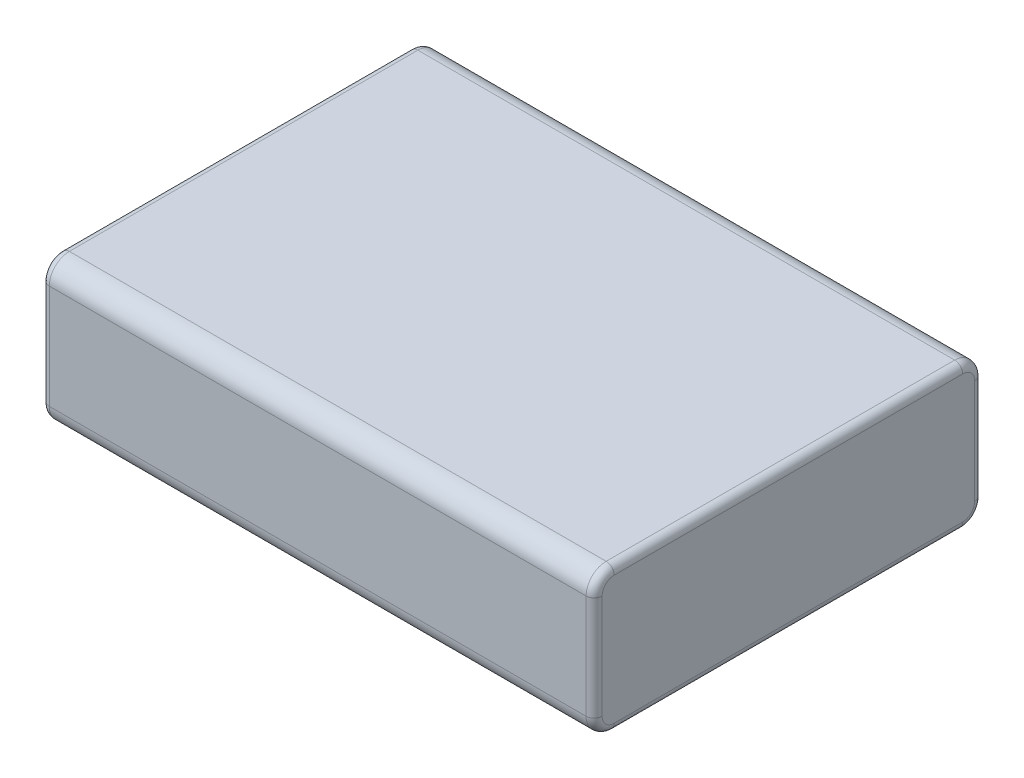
ISO-10303-21;
HEADER;
FILE_DESCRIPTION(('STEP AP214'),'2;1');
FILE_NAME('part.step','',(''),(''),'','','');
FILE_SCHEMA(('AUTOMOTIVE_DESIGN { 1 0 10303 214 1 1 1 1 }'));
ENDSEC;
DATA;
#1=APPLICATION_CONTEXT('core data for automotive mechanical design processes');
#2=APPLICATION_PROTOCOL_DEFINITION('international standard','automotive_design',2000,#1);
#3=PRODUCT_CONTEXT('',#1,'mechanical');
#4=PRODUCT('Part','Part','',(#3));
#5=PRODUCT_RELATED_PRODUCT_CATEGORY('part','',(#4));
#6=PRODUCT_DEFINITION_FORMATION('','',#4);
#7=PRODUCT_DEFINITION_CONTEXT('part definition',#1,'design');
#8=PRODUCT_DEFINITION('design','',#6,#7);
#9=PRODUCT_DEFINITION_SHAPE('','',#8);
#10=(LENGTH_UNIT() NAMED_UNIT(*) SI_UNIT(.MILLI.,.METRE.));
#11=(NAMED_UNIT(*) PLANE_ANGLE_UNIT() SI_UNIT($,.RADIAN.));
#12=(NAMED_UNIT(*) SI_UNIT($,.STERADIAN.) SOLID_ANGLE_UNIT());
#13=UNCERTAINTY_MEASURE_WITH_UNIT(LENGTH_MEASURE(1.E-05),#10,'distance_accuracy_value','');
#14=(GEOMETRIC_REPRESENTATION_CONTEXT(3) GLOBAL_UNCERTAINTY_ASSIGNED_CONTEXT((#13)) GLOBAL_UNIT_ASSIGNED_CONTEXT((#10,
#11,#12)) REPRESENTATION_CONTEXT('',''));
#15=CARTESIAN_POINT('',(0.,0.,0.));
#16=DIRECTION('',(0.,0.,1.));
#17=DIRECTION('',(1.,0.,0.));
#18=AXIS2_PLACEMENT_3D('',#15,#16,#17);
#19=CARTESIAN_POINT('',(0.,1.,0.));
#20=DIRECTION('',(0.,-1.,0.));
#21=DIRECTION('',(0.,0.,-1.));
#22=AXIS2_PLACEMENT_3D('',#19,#20,#21);
#23=PLANE('',#22);
#24=DIRECTION('',(0.,0.,-1.));
#25=VECTOR('',#24,1.);
#26=CARTESIAN_POINT('',(60.5,1.,-33.));
#27=LINE('',#26,#25);
#28=CARTESIAN_POINT('',(60.5,1.,-33.));
#29=VERTEX_POINT('',#28);
#30=CARTESIAN_POINT('',(60.5,1.,-42.));
#31=VERTEX_POINT('',#30);
#32=EDGE_CURVE('E231',#29,#31,#27,.T.);
#33=ORIENTED_EDGE('',*,*,#32,.T.);
#34=DIRECTION('',(1.,0.,0.));
#35=VECTOR('',#34,1.);
#36=CARTESIAN_POINT('',(60.5,1.,-42.));
#37=LINE('',#36,#35);
#38=CARTESIAN_POINT('',(65.,1.,-42.));
#39=VERTEX_POINT('',#38);
#40=EDGE_CURVE('E234',#31,#39,#37,.T.);
#41=ORIENTED_EDGE('',*,*,#40,.T.);
#42=DIRECTION('',(0.,0.,1.));
#43=VECTOR('',#42,1.);
#44=CARTESIAN_POINT('',(65.,1.,-33.));
#45=LINE('',#44,#43);
#46=CARTESIAN_POINT('',(65.,1.,-33.));
#47=VERTEX_POINT('',#46);
#48=EDGE_CURVE('E238',#39,#47,#45,.T.);
#49=ORIENTED_EDGE('',*,*,#48,.T.);
#50=DIRECTION('',(-1.,0.,0.));
#51=VECTOR('',#50,1.);
#52=CARTESIAN_POINT('',(60.5,1.,-33.));
#53=LINE('',#52,#51);
#54=EDGE_CURVE('E241',#47,#29,#53,.T.);
#55=ORIENTED_EDGE('',*,*,#54,.T.);
#56=EDGE_LOOP('',(#33,#41,#49,#55));
#57=FACE_BOUND('',#56,.T.);
#58=DIRECTION('',(1.,0.,0.));
#59=VECTOR('',#58,1.);
#60=CARTESIAN_POINT('',(61.25,1.,-36.75));
#61=LINE('',#60,#59);
#62=CARTESIAN_POINT('',(61.25,1.,-36.75));
#63=VERTEX_POINT('',#62);
#64=CARTESIAN_POINT('',(64.25,1.,-36.75));
#65=VERTEX_POINT('',#64);
#66=EDGE_CURVE('E805',#63,#65,#61,.T.);
#67=ORIENTED_EDGE('',*,*,#66,.F.);
#68=DIRECTION('',(0.,0.,-1.));
#69=VECTOR('',#68,1.);
#70=CARTESIAN_POINT('',(61.25,1.,-33.75));
#71=LINE('',#70,#69);
#72=CARTESIAN_POINT('',(61.25,1.,-33.75));
#73=VERTEX_POINT('',#72);
#74=EDGE_CURVE('E223',#73,#63,#71,.T.);
#75=ORIENTED_EDGE('',*,*,#74,.F.);
#76=DIRECTION('',(-1.,0.,0.));
#77=VECTOR('',#76,1.);
#78=CARTESIAN_POINT('',(61.25,1.,-33.75));
#79=LINE('',#78,#77);
#80=CARTESIAN_POINT('',(64.25,1.,-33.75));
#81=VERTEX_POINT('',#80);
#82=EDGE_CURVE('E219',#81,#73,#79,.T.);
#83=ORIENTED_EDGE('',*,*,#82,.F.);
#84=DIRECTION('',(0.,0.,1.));
#85=VECTOR('',#84,1.);
#86=CARTESIAN_POINT('',(64.25,1.,-33.75));
#87=LINE('',#86,#85);
#88=EDGE_CURVE('E802',#65,#81,#87,.T.);
#89=ORIENTED_EDGE('',*,*,#88,.F.);
#90=EDGE_LOOP('',(#67,#75,#83,#89));
#91=FACE_BOUND('',#90,.T.);
#92=ADVANCED_FACE('F38',(#57,#91),#23,.T.);
#93=CARTESIAN_POINT('',(0.,18.,0.));
#94=DIRECTION('',(1.,0.,0.));
#95=DIRECTION('',(0.,0.,-1.));
#96=AXIS2_PLACEMENT_3D('',#93,#94,#95);
#97=PLANE('',#96);
#98=DIRECTION('',(0.,0.,1.));
#99=VECTOR('',#98,1.);
#100=CARTESIAN_POINT('',(0.,17.,0.));
#101=LINE('',#100,#99);
#102=CARTESIAN_POINT('',(0.,17.,-2.5));
#103=VERTEX_POINT('',#102);
#104=CARTESIAN_POINT('',(0.,17.,-46.));
#105=VERTEX_POINT('',#104);
#106=EDGE_CURVE('E285',#103,#105,#101,.F.);
#107=ORIENTED_EDGE('',*,*,#106,.T.);
#108=CARTESIAN_POINT('',(0.,15.5,-46.));
#109=DIRECTION('',(1.,0.,0.));
#110=DIRECTION('',(0.,0.,-1.));
#111=AXIS2_PLACEMENT_3D('',#108,#109,#110);
#112=CIRCLE('',#111,1.5);
#113=CARTESIAN_POINT('',(0.,15.5,-47.5));
#114=VERTEX_POINT('',#113);
#115=EDGE_CURVE('E299',#105,#114,#112,.F.);
#116=ORIENTED_EDGE('',*,*,#115,.T.);
#117=DIRECTION('',(0.,-1.,0.));
#118=VECTOR('',#117,1.);
#119=CARTESIAN_POINT('',(0.,18.,-47.5));
#120=LINE('',#119,#118);
#121=CARTESIAN_POINT('',(0.,2.5,-47.5));
#122=VERTEX_POINT('',#121);
#123=EDGE_CURVE('E297',#114,#122,#120,.T.);
#124=ORIENTED_EDGE('',*,*,#123,.T.);
#125=CARTESIAN_POINT('',(0.,2.5,-46.));
#126=DIRECTION('',(1.,0.,0.));
#127=DIRECTION('',(0.,0.,-1.));
#128=AXIS2_PLACEMENT_3D('',#125,#126,#127);
#129=CIRCLE('',#128,1.5);
#130=CARTESIAN_POINT('',(0.,1.,-46.));
#131=VERTEX_POINT('',#130);
#132=EDGE_CURVE('E295',#122,#131,#129,.F.);
#133=ORIENTED_EDGE('',*,*,#132,.T.);
#134=DIRECTION('',(0.,0.,1.));
#135=VECTOR('',#134,1.);
#136=CARTESIAN_POINT('',(0.,1.,-2.5));
#137=LINE('',#136,#135);
#138=CARTESIAN_POINT('',(0.,1.,-2.5));
#139=VERTEX_POINT('',#138);
#140=EDGE_CURVE('E293',#131,#139,#137,.T.);
#141=ORIENTED_EDGE('',*,*,#140,.T.);
#142=CARTESIAN_POINT('',(0.,2.5,-2.5));
#143=DIRECTION('',(1.,0.,0.));
#144=DIRECTION('',(0.,0.,-1.));
#145=AXIS2_PLACEMENT_3D('',#142,#143,#144);
#146=CIRCLE('',#145,1.5);
#147=CARTESIAN_POINT('',(0.,2.5,-1.));
#148=VERTEX_POINT('',#147);
#149=EDGE_CURVE('E291',#139,#148,#146,.F.);
#150=ORIENTED_EDGE('',*,*,#149,.T.);
#151=DIRECTION('',(0.,-1.,0.));
#152=VECTOR('',#151,1.);
#153=CARTESIAN_POINT('',(0.,18.,-1.));
#154=LINE('',#153,#152);
#155=CARTESIAN_POINT('',(0.,15.5,-1.));
#156=VERTEX_POINT('',#155);
#157=EDGE_CURVE('E289',#148,#156,#154,.F.);
#158=ORIENTED_EDGE('',*,*,#157,.T.);
#159=CARTESIAN_POINT('',(0.,15.5,-2.5));
#160=DIRECTION('',(1.,0.,0.));
#161=DIRECTION('',(0.,0.,-1.));
#162=AXIS2_PLACEMENT_3D('',#159,#160,#161);
#163=CIRCLE('',#162,1.5);
#164=EDGE_CURVE('E287',#156,#103,#163,.F.);
#165=ORIENTED_EDGE('',*,*,#164,.T.);
#166=EDGE_LOOP('',(#107,#116,#124,#133,#141,#150,#158,#165));
#167=FACE_BOUND('',#166,.T.);
#168=ADVANCED_FACE('F438',(#167),#97,.F.);
#169=CARTESIAN_POINT('',(0.,18.,0.));
#170=DIRECTION('',(0.,0.,-1.));
#171=DIRECTION('',(-1.,0.,0.));
#172=AXIS2_PLACEMENT_3D('',#169,#170,#171);
#173=PLANE('',#172);
#174=DIRECTION('',(1.,0.,0.));
#175=VECTOR('',#174,1.);
#176=CARTESIAN_POINT('',(0.,15.5,0.));
#177=LINE('',#176,#175);
#178=CARTESIAN_POINT('',(68.,15.5,0.));
#179=VERTEX_POINT('',#178);
#180=CARTESIAN_POINT('',(1.,15.5,0.));
#181=VERTEX_POINT('',#180);
#182=EDGE_CURVE('E279',#179,#181,#177,.F.);
#183=ORIENTED_EDGE('',*,*,#182,.T.);
#184=DIRECTION('',(0.,-1.,0.));
#185=VECTOR('',#184,1.);
#186=CARTESIAN_POINT('',(1.,18.,0.));
#187=LINE('',#186,#185);
#188=CARTESIAN_POINT('',(1.,2.5,0.));
#189=VERTEX_POINT('',#188);
#190=EDGE_CURVE('E325',#181,#189,#187,.T.);
#191=ORIENTED_EDGE('',*,*,#190,.T.);
#192=DIRECTION('',(1.,0.,0.));
#193=VECTOR('',#192,1.);
#194=CARTESIAN_POINT('',(69.,2.5,0.));
#195=LINE('',#194,#193);
#196=CARTESIAN_POINT('',(68.,2.5,0.));
#197=VERTEX_POINT('',#196);
#198=EDGE_CURVE('E282',#189,#197,#195,.T.);
#199=ORIENTED_EDGE('',*,*,#198,.T.);
#200=DIRECTION('',(0.,-1.,0.));
#201=VECTOR('',#200,1.);
#202=CARTESIAN_POINT('',(68.,18.,0.));
#203=LINE('',#202,#201);
#204=EDGE_CURVE('E323',#197,#179,#203,.F.);
#205=ORIENTED_EDGE('',*,*,#204,.T.);
#206=EDGE_LOOP('',(#183,#191,#199,#205));
#207=FACE_BOUND('',#206,.T.);
#208=ADVANCED_FACE('F462',(#207),#173,.F.);
#209=CARTESIAN_POINT('',(69.,18.,0.));
#210=DIRECTION('',(-1.,0.,0.));
#211=DIRECTION('',(0.,0.,1.));
#212=AXIS2_PLACEMENT_3D('',#209,#210,#211);
#213=PLANE('',#212);
#214=DIRECTION('',(0.,0.,-1.));
#215=VECTOR('',#214,1.);
#216=CARTESIAN_POINT('',(69.,17.,0.));
#217=LINE('',#216,#215);
#218=CARTESIAN_POINT('',(69.,17.,-46.));
#219=VERTEX_POINT('',#218);
#220=CARTESIAN_POINT('',(69.,17.,-2.5));
#221=VERTEX_POINT('',#220);
#222=EDGE_CURVE('E332',#219,#221,#217,.F.);
#223=ORIENTED_EDGE('',*,*,#222,.T.);
#224=CARTESIAN_POINT('',(69.,15.5,-2.5));
#225=DIRECTION('',(-1.,0.,0.));
#226=DIRECTION('',(0.,0.,1.));
#227=AXIS2_PLACEMENT_3D('',#224,#225,#226);
#228=CIRCLE('',#227,1.5);
#229=CARTESIAN_POINT('',(69.,15.5,-1.));
#230=VERTEX_POINT('',#229);
#231=EDGE_CURVE('E346',#221,#230,#228,.F.);
#232=ORIENTED_EDGE('',*,*,#231,.T.);
#233=DIRECTION('',(0.,-1.,0.));
#234=VECTOR('',#233,1.);
#235=CARTESIAN_POINT('',(69.,18.,-1.));
#236=LINE('',#235,#234);
#237=CARTESIAN_POINT('',(69.,2.5,-1.));
#238=VERTEX_POINT('',#237);
#239=EDGE_CURVE('E344',#230,#238,#236,.T.);
#240=ORIENTED_EDGE('',*,*,#239,.T.);
#241=CARTESIAN_POINT('',(69.,2.5,-2.5));
#242=DIRECTION('',(-1.,0.,0.));
#243=DIRECTION('',(0.,0.,1.));
#244=AXIS2_PLACEMENT_3D('',#241,#242,#243);
#245=CIRCLE('',#244,1.5);
#246=CARTESIAN_POINT('',(69.,1.,-2.5));
#247=VERTEX_POINT('',#246);
#248=EDGE_CURVE('E342',#238,#247,#245,.F.);
#249=ORIENTED_EDGE('',*,*,#248,.T.);
#250=DIRECTION('',(0.,0.,-1.));
#251=VECTOR('',#250,1.);
#252=CARTESIAN_POINT('',(69.,1.,-46.));
#253=LINE('',#252,#251);
#254=CARTESIAN_POINT('',(69.,1.,-46.));
#255=VERTEX_POINT('',#254);
#256=EDGE_CURVE('E340',#247,#255,#253,.T.);
#257=ORIENTED_EDGE('',*,*,#256,.T.);
#258=CARTESIAN_POINT('',(69.,2.5,-46.));
#259=DIRECTION('',(-1.,0.,0.));
#260=DIRECTION('',(0.,0.,1.));
#261=AXIS2_PLACEMENT_3D('',#258,#259,#260);
#262=CIRCLE('',#261,1.5);
#263=CARTESIAN_POINT('',(69.,2.5,-47.5));
#264=VERTEX_POINT('',#263);
#265=EDGE_CURVE('E338',#255,#264,#262,.F.);
#266=ORIENTED_EDGE('',*,*,#265,.T.);
#267=DIRECTION('',(0.,-1.,0.));
#268=VECTOR('',#267,1.);
#269=CARTESIAN_POINT('',(69.,18.,-47.5));
#270=LINE('',#269,#268);
#271=CARTESIAN_POINT('',(69.,15.5,-47.5));
#272=VERTEX_POINT('',#271);
#273=EDGE_CURVE('E336',#264,#272,#270,.F.);
#274=ORIENTED_EDGE('',*,*,#273,.T.);
#275=CARTESIAN_POINT('',(69.,15.5,-46.));
#276=DIRECTION('',(-1.,0.,0.));
#277=DIRECTION('',(0.,0.,1.));
#278=AXIS2_PLACEMENT_3D('',#275,#276,#277);
#279=CIRCLE('',#278,1.5);
#280=EDGE_CURVE('E334',#272,#219,#279,.F.);
#281=ORIENTED_EDGE('',*,*,#280,.T.);
#282=EDGE_LOOP('',(#223,#232,#240,#249,#257,#266,#274,#281));
#283=FACE_BOUND('',#282,.T.);
#284=ADVANCED_FACE('F514',(#283),#213,.F.);
#285=CARTESIAN_POINT('',(0.,18.,-48.5));
#286=DIRECTION('',(0.,0.,1.));
#287=DIRECTION('',(1.,0.,0.));
#288=AXIS2_PLACEMENT_3D('',#285,#286,#287);
#289=PLANE('',#288);
#290=DIRECTION('',(-1.,0.,0.));
#291=VECTOR('',#290,1.);
#292=CARTESIAN_POINT('',(0.,2.5,-48.5));
#293=LINE('',#292,#291);
#294=CARTESIAN_POINT('',(68.,2.5,-48.5));
#295=VERTEX_POINT('',#294);
#296=CARTESIAN_POINT('',(1.,2.5,-48.5));
#297=VERTEX_POINT('',#296);
#298=EDGE_CURVE('E263',#295,#297,#293,.T.);
#299=ORIENTED_EDGE('',*,*,#298,.T.);
#300=DIRECTION('',(0.,-1.,0.));
#301=VECTOR('',#300,1.);
#302=CARTESIAN_POINT('',(1.,18.,-48.5));
#303=LINE('',#302,#301);
#304=CARTESIAN_POINT('',(1.,15.5,-48.5));
#305=VERTEX_POINT('',#304);
#306=EDGE_CURVE('E309',#297,#305,#303,.F.);
#307=ORIENTED_EDGE('',*,*,#306,.T.);
#308=DIRECTION('',(-1.,0.,0.));
#309=VECTOR('',#308,1.);
#310=CARTESIAN_POINT('',(0.,15.5,-48.5));
#311=LINE('',#310,#309);
#312=CARTESIAN_POINT('',(68.,15.5,-48.5));
#313=VERTEX_POINT('',#312);
#314=EDGE_CURVE('E260',#305,#313,#311,.F.);
#315=ORIENTED_EDGE('',*,*,#314,.T.);
#316=DIRECTION('',(0.,-1.,0.));
#317=VECTOR('',#316,1.);
#318=CARTESIAN_POINT('',(68.,18.,-48.5));
#319=LINE('',#318,#317);
#320=EDGE_CURVE('E307',#313,#295,#319,.T.);
#321=ORIENTED_EDGE('',*,*,#320,.T.);
#322=EDGE_LOOP('',(#299,#307,#315,#321));
#323=FACE_BOUND('',#322,.T.);
#324=ADVANCED_FACE('F421',(#323),#289,.F.);
#325=CARTESIAN_POINT('',(0.,18.,0.));
#326=DIRECTION('',(0.,-1.,0.));
#327=DIRECTION('',(0.,0.,-1.));
#328=AXIS2_PLACEMENT_3D('',#325,#326,#327);
#329=PLANE('',#328);
#330=DIRECTION('',(-1.,0.,0.));
#331=VECTOR('',#330,1.);
#332=CARTESIAN_POINT('',(0.,18.,-46.));
#333=LINE('',#332,#331);
#334=CARTESIAN_POINT('',(68.,18.,-46.));
#335=VERTEX_POINT('',#334);
#336=CARTESIAN_POINT('',(1.,18.,-46.));
#337=VERTEX_POINT('',#336);
#338=EDGE_CURVE('E276',#335,#337,#333,.T.);
#339=ORIENTED_EDGE('',*,*,#338,.T.);
#340=DIRECTION('',(0.,0.,1.));
#341=VECTOR('',#340,1.);
#342=CARTESIAN_POINT('',(1.,18.,0.));
#343=LINE('',#342,#341);
#344=CARTESIAN_POINT('',(1.,18.,-2.5));
#345=VERTEX_POINT('',#344);
#346=EDGE_CURVE('E11',#337,#345,#343,.T.);
#347=ORIENTED_EDGE('',*,*,#346,.T.);
#348=DIRECTION('',(1.,0.,0.));
#349=VECTOR('',#348,1.);
#350=CARTESIAN_POINT('',(0.,18.,-2.5));
#351=LINE('',#350,#349);
#352=CARTESIAN_POINT('',(68.,18.,-2.5));
#353=VERTEX_POINT('',#352);
#354=EDGE_CURVE('E273',#345,#353,#351,.T.);
#355=ORIENTED_EDGE('',*,*,#354,.T.);
#356=DIRECTION('',(0.,0.,-1.));
#357=VECTOR('',#356,1.);
#358=CARTESIAN_POINT('',(68.,18.,0.));
#359=LINE('',#358,#357);
#360=EDGE_CURVE('E47',#353,#335,#359,.T.);
#361=ORIENTED_EDGE('',*,*,#360,.T.);
#362=EDGE_LOOP('',(#339,#347,#355,#361));
#363=FACE_BOUND('',#362,.T.);
#364=ADVANCED_FACE('F446',(#363),#329,.F.);
#365=CARTESIAN_POINT('',(0.,0.,0.));
#366=DIRECTION('',(0.,-1.,0.));
#367=DIRECTION('',(0.,0.,-1.));
#368=AXIS2_PLACEMENT_3D('',#365,#366,#367);
#369=PLANE('',#368);
#370=DIRECTION('',(0.,0.,-1.));
#371=VECTOR('',#370,1.);
#372=CARTESIAN_POINT('',(60.5,0.,-33.));
#373=LINE('',#372,#371);
#374=CARTESIAN_POINT('',(60.5,0.,-33.));
#375=VERTEX_POINT('',#374);
#376=CARTESIAN_POINT('',(60.5,0.,-42.));
#377=VERTEX_POINT('',#376);
#378=EDGE_CURVE('E63',#375,#377,#373,.T.);
#379=ORIENTED_EDGE('',*,*,#378,.F.);
#380=DIRECTION('',(-1.,0.,0.));
#381=VECTOR('',#380,1.);
#382=CARTESIAN_POINT('',(60.5,0.,-33.));
#383=LINE('',#382,#381);
#384=CARTESIAN_POINT('',(65.,0.,-33.));
#385=VERTEX_POINT('',#384);
#386=EDGE_CURVE('E235',#385,#375,#383,.T.);
#387=ORIENTED_EDGE('',*,*,#386,.F.);
#388=DIRECTION('',(0.,0.,1.));
#389=VECTOR('',#388,1.);
#390=CARTESIAN_POINT('',(65.,0.,-33.));
#391=LINE('',#390,#389);
#392=CARTESIAN_POINT('',(65.,0.,-42.));
#393=VERTEX_POINT('',#392);
#394=EDGE_CURVE('E247',#393,#385,#391,.T.);
#395=ORIENTED_EDGE('',*,*,#394,.F.);
#396=DIRECTION('',(1.,0.,0.));
#397=VECTOR('',#396,1.);
#398=CARTESIAN_POINT('',(60.5,0.,-42.));
#399=LINE('',#398,#397);
#400=EDGE_CURVE('E226',#377,#393,#399,.T.);
#401=ORIENTED_EDGE('',*,*,#400,.F.);
#402=EDGE_LOOP('',(#379,#387,#395,#401));
#403=FACE_BOUND('',#402,.T.);
#404=DIRECTION('',(1.,0.,0.));
#405=VECTOR('',#404,1.);
#406=CARTESIAN_POINT('',(0.,0.,-2.5));
#407=LINE('',#406,#405);
#408=CARTESIAN_POINT('',(68.,0.,-2.5));
#409=VERTEX_POINT('',#408);
#410=CARTESIAN_POINT('',(1.,0.,-2.5));
#411=VERTEX_POINT('',#410);
#412=EDGE_CURVE('E267',#409,#411,#407,.F.);
#413=ORIENTED_EDGE('',*,*,#412,.T.);
#414=DIRECTION('',(0.,0.,1.));
#415=VECTOR('',#414,1.);
#416=CARTESIAN_POINT('',(1.,0.,-46.));
#417=LINE('',#416,#415);
#418=CARTESIAN_POINT('',(1.,0.,-46.));
#419=VERTEX_POINT('',#418);
#420=EDGE_CURVE('E317',#411,#419,#417,.F.);
#421=ORIENTED_EDGE('',*,*,#420,.T.);
#422=DIRECTION('',(-1.,0.,0.));
#423=VECTOR('',#422,1.);
#424=CARTESIAN_POINT('',(69.,0.,-46.));
#425=LINE('',#424,#423);
#426=CARTESIAN_POINT('',(68.,0.,-46.));
#427=VERTEX_POINT('',#426);
#428=EDGE_CURVE('E270',#419,#427,#425,.F.);
#429=ORIENTED_EDGE('',*,*,#428,.T.);
#430=DIRECTION('',(0.,0.,-1.));
#431=VECTOR('',#430,1.);
#432=CARTESIAN_POINT('',(68.,0.,-2.5));
#433=LINE('',#432,#431);
#434=EDGE_CURVE('E315',#427,#409,#433,.F.);
#435=ORIENTED_EDGE('',*,*,#434,.T.);
#436=EDGE_LOOP('',(#413,#421,#429,#435));
#437=FACE_BOUND('',#436,.T.);
#438=ADVANCED_FACE('F407',(#403,#437),#369,.T.);
#439=CARTESIAN_POINT('',(0.,2.5,-46.));
#440=DIRECTION('',(1.,0.,0.));
#441=DIRECTION('',(0.,0.,-1.));
#442=AXIS2_PLACEMENT_3D('',#439,#440,#441);
#443=CYLINDRICAL_SURFACE('',#442,2.5);
#444=ORIENTED_EDGE('',*,*,#428,.F.);
#445=CARTESIAN_POINT('',(1.,2.5,-46.));
#446=DIRECTION('',(1.,0.,0.));
#447=DIRECTION('',(0.,0.,-1.));
#448=AXIS2_PLACEMENT_3D('',#445,#446,#447);
#449=CIRCLE('',#448,2.5);
#450=EDGE_CURVE('E313',#419,#297,#449,.T.);
#451=ORIENTED_EDGE('',*,*,#450,.T.);
#452=ORIENTED_EDGE('',*,*,#298,.F.);
#453=CARTESIAN_POINT('',(68.,2.5,-46.));
#454=DIRECTION('',(-1.,0.,0.));
#455=DIRECTION('',(0.,0.,1.));
#456=AXIS2_PLACEMENT_3D('',#453,#454,#455);
#457=CIRCLE('',#456,2.5);
#458=EDGE_CURVE('E311',#295,#427,#457,.T.);
#459=ORIENTED_EDGE('',*,*,#458,.T.);
#460=EDGE_LOOP('',(#444,#451,#452,#459));
#461=FACE_BOUND('',#460,.T.);
#462=ADVANCED_FACE('F404',(#461),#443,.T.);
#463=CARTESIAN_POINT('',(0.,15.5,-46.));
#464=DIRECTION('',(-1.,0.,0.));
#465=DIRECTION('',(0.,0.,1.));
#466=AXIS2_PLACEMENT_3D('',#463,#464,#465);
#467=CYLINDRICAL_SURFACE('',#466,2.5);
#468=ORIENTED_EDGE('',*,*,#314,.F.);
#469=CARTESIAN_POINT('',(1.,15.5,-46.));
#470=DIRECTION('',(1.,0.,0.));
#471=DIRECTION('',(0.,0.,-1.));
#472=AXIS2_PLACEMENT_3D('',#469,#470,#471);
#473=CIRCLE('',#472,2.5);
#474=EDGE_CURVE('E304',#305,#337,#473,.T.);
#475=ORIENTED_EDGE('',*,*,#474,.T.);
#476=ORIENTED_EDGE('',*,*,#338,.F.);
#477=CARTESIAN_POINT('',(68.,15.5,-46.));
#478=DIRECTION('',(-1.,0.,0.));
#479=DIRECTION('',(0.,0.,1.));
#480=AXIS2_PLACEMENT_3D('',#477,#478,#479);
#481=CIRCLE('',#480,2.5);
#482=EDGE_CURVE('E302',#335,#313,#481,.T.);
#483=ORIENTED_EDGE('',*,*,#482,.T.);
#484=EDGE_LOOP('',(#468,#475,#476,#483));
#485=FACE_BOUND('',#484,.T.);
#486=ADVANCED_FACE('F425',(#485),#467,.T.);
#487=CARTESIAN_POINT('',(0.,2.5,-2.5));
#488=DIRECTION('',(-1.,0.,0.));
#489=DIRECTION('',(0.,0.,1.));
#490=AXIS2_PLACEMENT_3D('',#487,#488,#489);
#491=CYLINDRICAL_SURFACE('',#490,2.5);
#492=ORIENTED_EDGE('',*,*,#198,.F.);
#493=CARTESIAN_POINT('',(1.,2.5,-2.5));
#494=DIRECTION('',(1.,0.,0.));
#495=DIRECTION('',(0.,0.,-1.));
#496=AXIS2_PLACEMENT_3D('',#493,#494,#495);
#497=CIRCLE('',#496,2.5);
#498=EDGE_CURVE('E321',#189,#411,#497,.T.);
#499=ORIENTED_EDGE('',*,*,#498,.T.);
#500=ORIENTED_EDGE('',*,*,#412,.F.);
#501=CARTESIAN_POINT('',(68.,2.5,-2.5));
#502=DIRECTION('',(-1.,0.,0.));
#503=DIRECTION('',(0.,0.,1.));
#504=AXIS2_PLACEMENT_3D('',#501,#502,#503);
#505=CIRCLE('',#504,2.5);
#506=EDGE_CURVE('E319',#409,#197,#505,.T.);
#507=ORIENTED_EDGE('',*,*,#506,.T.);
#508=EDGE_LOOP('',(#492,#499,#500,#507));
#509=FACE_BOUND('',#508,.T.);
#510=ADVANCED_FACE('F466',(#509),#491,.T.);
#511=CARTESIAN_POINT('',(0.,15.5,-2.5));
#512=DIRECTION('',(1.,0.,0.));
#513=DIRECTION('',(0.,0.,-1.));
#514=AXIS2_PLACEMENT_3D('',#511,#512,#513);
#515=CYLINDRICAL_SURFACE('',#514,2.5);
#516=ORIENTED_EDGE('',*,*,#354,.F.);
#517=CARTESIAN_POINT('',(1.,15.5,-2.5));
#518=DIRECTION('',(1.,0.,0.));
#519=DIRECTION('',(0.,0.,-1.));
#520=AXIS2_PLACEMENT_3D('',#517,#518,#519);
#521=CIRCLE('',#520,2.5);
#522=EDGE_CURVE('E330',#345,#181,#521,.T.);
#523=ORIENTED_EDGE('',*,*,#522,.T.);
#524=ORIENTED_EDGE('',*,*,#182,.F.);
#525=CARTESIAN_POINT('',(68.,15.5,-2.5));
#526=DIRECTION('',(-1.,0.,0.));
#527=DIRECTION('',(0.,0.,1.));
#528=AXIS2_PLACEMENT_3D('',#525,#526,#527);
#529=CIRCLE('',#528,2.5);
#530=EDGE_CURVE('E327',#179,#353,#529,.T.);
#531=ORIENTED_EDGE('',*,*,#530,.T.);
#532=EDGE_LOOP('',(#516,#523,#524,#531));
#533=FACE_BOUND('',#532,.T.);
#534=ADVANCED_FACE('F449',(#533),#515,.T.);
#535=CARTESIAN_POINT('',(1.,2.5,-2.5));
#536=DIRECTION('',(1.,0.,0.));
#537=DIRECTION('',(0.,0.,-1.));
#538=AXIS2_PLACEMENT_3D('',#535,#536,#537);
#539=TOROIDAL_SURFACE('',#538,1.5,1.);
#540=CARTESIAN_POINT('',(1.,1.,-2.5));
#541=DIRECTION('',(0.,0.,-1.));
#542=DIRECTION('',(-1.,0.,0.));
#543=AXIS2_PLACEMENT_3D('',#540,#541,#542);
#544=CIRCLE('',#543,1.);
#545=EDGE_CURVE('E366',#411,#139,#544,.T.);
#546=ORIENTED_EDGE('',*,*,#545,.F.);
#547=ORIENTED_EDGE('',*,*,#498,.F.);
#548=CARTESIAN_POINT('',(1.,2.5,-1.));
#549=DIRECTION('',(0.,1.,0.));
#550=DIRECTION('',(0.,0.,1.));
#551=AXIS2_PLACEMENT_3D('',#548,#549,#550);
#552=CIRCLE('',#551,1.);
#553=EDGE_CURVE('E264',#148,#189,#552,.T.);
#554=ORIENTED_EDGE('',*,*,#553,.F.);
#555=ORIENTED_EDGE('',*,*,#149,.F.);
#556=EDGE_LOOP('',(#546,#547,#554,#555));
#557=FACE_BOUND('',#556,.T.);
#558=ADVANCED_FACE('F469',(#557),#539,.T.);
#559=CARTESIAN_POINT('',(1.,18.,-1.));
#560=DIRECTION('',(0.,-1.,0.));
#561=DIRECTION('',(0.,0.,-1.));
#562=AXIS2_PLACEMENT_3D('',#559,#560,#561);
#563=CYLINDRICAL_SURFACE('',#562,1.);
#564=ORIENTED_EDGE('',*,*,#553,.T.);
#565=ORIENTED_EDGE('',*,*,#190,.F.);
#566=CARTESIAN_POINT('',(1.,15.5,-1.));
#567=DIRECTION('',(0.,1.,0.));
#568=DIRECTION('',(0.,0.,1.));
#569=AXIS2_PLACEMENT_3D('',#566,#567,#568);
#570=CIRCLE('',#569,1.);
#571=EDGE_CURVE('E363',#156,#181,#570,.T.);
#572=ORIENTED_EDGE('',*,*,#571,.F.);
#573=ORIENTED_EDGE('',*,*,#157,.F.);
#574=EDGE_LOOP('',(#564,#565,#572,#573));
#575=FACE_BOUND('',#574,.T.);
#576=ADVANCED_FACE('F458',(#575),#563,.T.);
#577=CARTESIAN_POINT('',(1.,1.,0.));
#578=DIRECTION('',(0.,0.,-1.));
#579=DIRECTION('',(-1.,0.,0.));
#580=AXIS2_PLACEMENT_3D('',#577,#578,#579);
#581=CYLINDRICAL_SURFACE('',#580,1.);
#582=ORIENTED_EDGE('',*,*,#545,.T.);
#583=ORIENTED_EDGE('',*,*,#140,.F.);
#584=CARTESIAN_POINT('',(1.,1.,-46.));
#585=DIRECTION('',(0.,0.,-1.));
#586=DIRECTION('',(-1.,0.,0.));
#587=AXIS2_PLACEMENT_3D('',#584,#585,#586);
#588=CIRCLE('',#587,1.);
#589=EDGE_CURVE('E360',#419,#131,#588,.T.);
#590=ORIENTED_EDGE('',*,*,#589,.F.);
#591=ORIENTED_EDGE('',*,*,#420,.F.);
#592=EDGE_LOOP('',(#582,#583,#590,#591));
#593=FACE_BOUND('',#592,.T.);
#594=ADVANCED_FACE('F412',(#593),#581,.T.);
#595=CARTESIAN_POINT('',(1.,15.5,-2.5));
#596=DIRECTION('',(1.,0.,0.));
#597=DIRECTION('',(0.,0.,-1.));
#598=AXIS2_PLACEMENT_3D('',#595,#596,#597);
#599=TOROIDAL_SURFACE('',#598,1.5,1.);
#600=ORIENTED_EDGE('',*,*,#571,.T.);
#601=ORIENTED_EDGE('',*,*,#522,.F.);
#602=CARTESIAN_POINT('',(1.,17.,-2.5));
#603=DIRECTION('',(0.,0.,-1.));
#604=DIRECTION('',(-1.,0.,0.));
#605=AXIS2_PLACEMENT_3D('',#602,#603,#604);
#606=CIRCLE('',#605,1.);
#607=EDGE_CURVE('E357',#103,#345,#606,.T.);
#608=ORIENTED_EDGE('',*,*,#607,.F.);
#609=ORIENTED_EDGE('',*,*,#164,.F.);
#610=EDGE_LOOP('',(#600,#601,#608,#609));
#611=FACE_BOUND('',#610,.T.);
#612=ADVANCED_FACE('F453',(#611),#599,.T.);
#613=CARTESIAN_POINT('',(1.,2.5,-46.));
#614=DIRECTION('',(1.,0.,0.));
#615=DIRECTION('',(0.,0.,-1.));
#616=AXIS2_PLACEMENT_3D('',#613,#614,#615);
#617=TOROIDAL_SURFACE('',#616,1.5,1.);
#618=ORIENTED_EDGE('',*,*,#589,.T.);
#619=ORIENTED_EDGE('',*,*,#132,.F.);
#620=CARTESIAN_POINT('',(1.,2.5,-47.5));
#621=DIRECTION('',(0.,1.,0.));
#622=DIRECTION('',(0.,0.,1.));
#623=AXIS2_PLACEMENT_3D('',#620,#621,#622);
#624=CIRCLE('',#623,1.);
#625=EDGE_CURVE('E354',#297,#122,#624,.T.);
#626=ORIENTED_EDGE('',*,*,#625,.F.);
#627=ORIENTED_EDGE('',*,*,#450,.F.);
#628=EDGE_LOOP('',(#618,#619,#626,#627));
#629=FACE_BOUND('',#628,.T.);
#630=ADVANCED_FACE('F418',(#629),#617,.T.);
#631=CARTESIAN_POINT('',(1.,17.,0.));
#632=DIRECTION('',(0.,0.,1.));
#633=DIRECTION('',(1.,0.,0.));
#634=AXIS2_PLACEMENT_3D('',#631,#632,#633);
#635=CYLINDRICAL_SURFACE('',#634,1.);
#636=ORIENTED_EDGE('',*,*,#607,.T.);
#637=ORIENTED_EDGE('',*,*,#346,.F.);
#638=CARTESIAN_POINT('',(1.,17.,-46.));
#639=DIRECTION('',(0.,0.,-1.));
#640=DIRECTION('',(-1.,0.,0.));
#641=AXIS2_PLACEMENT_3D('',#638,#639,#640);
#642=CIRCLE('',#641,1.);
#643=EDGE_CURVE('E352',#105,#337,#642,.T.);
#644=ORIENTED_EDGE('',*,*,#643,.F.);
#645=ORIENTED_EDGE('',*,*,#106,.F.);
#646=EDGE_LOOP('',(#636,#637,#644,#645));
#647=FACE_BOUND('',#646,.T.);
#648=ADVANCED_FACE('F443',(#647),#635,.T.);
#649=CARTESIAN_POINT('',(1.,18.,-47.5));
#650=DIRECTION('',(0.,-1.,0.));
#651=DIRECTION('',(0.,0.,-1.));
#652=AXIS2_PLACEMENT_3D('',#649,#650,#651);
#653=CYLINDRICAL_SURFACE('',#652,1.);
#654=ORIENTED_EDGE('',*,*,#625,.T.);
#655=ORIENTED_EDGE('',*,*,#123,.F.);
#656=CARTESIAN_POINT('',(1.,15.5,-47.5));
#657=DIRECTION('',(0.,1.,0.));
#658=DIRECTION('',(0.,0.,1.));
#659=AXIS2_PLACEMENT_3D('',#656,#657,#658);
#660=CIRCLE('',#659,1.);
#661=EDGE_CURVE('E350',#305,#114,#660,.T.);
#662=ORIENTED_EDGE('',*,*,#661,.F.);
#663=ORIENTED_EDGE('',*,*,#306,.F.);
#664=EDGE_LOOP('',(#654,#655,#662,#663));
#665=FACE_BOUND('',#664,.T.);
#666=ADVANCED_FACE('F436',(#665),#653,.T.);
#667=CARTESIAN_POINT('',(1.,15.5,-46.));
#668=DIRECTION('',(1.,0.,0.));
#669=DIRECTION('',(0.,0.,-1.));
#670=AXIS2_PLACEMENT_3D('',#667,#668,#669);
#671=TOROIDAL_SURFACE('',#670,1.5,1.);
#672=ORIENTED_EDGE('',*,*,#643,.T.);
#673=ORIENTED_EDGE('',*,*,#474,.F.);
#674=ORIENTED_EDGE('',*,*,#661,.T.);
#675=ORIENTED_EDGE('',*,*,#115,.F.);
#676=EDGE_LOOP('',(#672,#673,#674,#675));
#677=FACE_BOUND('',#676,.T.);
#678=ADVANCED_FACE('F430',(#677),#671,.T.);
#679=CARTESIAN_POINT('',(68.,2.5,-46.));
#680=DIRECTION('',(-1.,0.,0.));
#681=DIRECTION('',(0.,0.,1.));
#682=AXIS2_PLACEMENT_3D('',#679,#680,#681);
#683=TOROIDAL_SURFACE('',#682,1.5,1.);
#684=CARTESIAN_POINT('',(68.,1.,-46.));
#685=DIRECTION('',(0.,0.,1.));
#686=DIRECTION('',(1.,0.,0.));
#687=AXIS2_PLACEMENT_3D('',#684,#685,#686);
#688=CIRCLE('',#687,1.);
#689=EDGE_CURVE('E385',#427,#255,#688,.T.);
#690=ORIENTED_EDGE('',*,*,#689,.F.);
#691=ORIENTED_EDGE('',*,*,#458,.F.);
#692=CARTESIAN_POINT('',(68.,2.5,-47.5));
#693=DIRECTION('',(0.,1.,0.));
#694=DIRECTION('',(0.,0.,1.));
#695=AXIS2_PLACEMENT_3D('',#692,#693,#694);
#696=CIRCLE('',#695,1.);
#697=EDGE_CURVE('E42',#264,#295,#696,.T.);
#698=ORIENTED_EDGE('',*,*,#697,.F.);
#699=ORIENTED_EDGE('',*,*,#265,.F.);
#700=EDGE_LOOP('',(#690,#691,#698,#699));
#701=FACE_BOUND('',#700,.T.);
#702=ADVANCED_FACE('F40',(#701),#683,.T.);
#703=CARTESIAN_POINT('',(68.,18.,-47.5));
#704=DIRECTION('',(0.,-1.,0.));
#705=DIRECTION('',(0.,0.,-1.));
#706=AXIS2_PLACEMENT_3D('',#703,#704,#705);
#707=CYLINDRICAL_SURFACE('',#706,1.);
#708=ORIENTED_EDGE('',*,*,#697,.T.);
#709=ORIENTED_EDGE('',*,*,#320,.F.);
#710=CARTESIAN_POINT('',(68.,15.5,-47.5));
#711=DIRECTION('',(0.,1.,0.));
#712=DIRECTION('',(0.,0.,1.));
#713=AXIS2_PLACEMENT_3D('',#710,#711,#712);
#714=CIRCLE('',#713,1.);
#715=EDGE_CURVE('E383',#272,#313,#714,.T.);
#716=ORIENTED_EDGE('',*,*,#715,.F.);
#717=ORIENTED_EDGE('',*,*,#273,.F.);
#718=EDGE_LOOP('',(#708,#709,#716,#717));
#719=FACE_BOUND('',#718,.T.);
#720=ADVANCED_FACE('F396',(#719),#707,.T.);
#721=CARTESIAN_POINT('',(68.,1.,0.));
#722=DIRECTION('',(0.,0.,1.));
#723=DIRECTION('',(1.,0.,0.));
#724=AXIS2_PLACEMENT_3D('',#721,#722,#723);
#725=CYLINDRICAL_SURFACE('',#724,1.);
#726=ORIENTED_EDGE('',*,*,#689,.T.);
#727=ORIENTED_EDGE('',*,*,#256,.F.);
#728=CARTESIAN_POINT('',(68.,1.,-2.5));
#729=DIRECTION('',(0.,0.,1.));
#730=DIRECTION('',(1.,0.,0.));
#731=AXIS2_PLACEMENT_3D('',#728,#729,#730);
#732=CIRCLE('',#731,1.);
#733=EDGE_CURVE('E380',#409,#247,#732,.T.);
#734=ORIENTED_EDGE('',*,*,#733,.F.);
#735=ORIENTED_EDGE('',*,*,#434,.F.);
#736=EDGE_LOOP('',(#726,#727,#734,#735));
#737=FACE_BOUND('',#736,.T.);
#738=ADVANCED_FACE('F572',(#737),#725,.T.);
#739=CARTESIAN_POINT('',(68.,15.5,-46.));
#740=DIRECTION('',(-1.,0.,0.));
#741=DIRECTION('',(0.,0.,1.));
#742=AXIS2_PLACEMENT_3D('',#739,#740,#741);
#743=TOROIDAL_SURFACE('',#742,1.5,1.);
#744=ORIENTED_EDGE('',*,*,#715,.T.);
#745=ORIENTED_EDGE('',*,*,#482,.F.);
#746=CARTESIAN_POINT('',(68.,17.,-46.));
#747=DIRECTION('',(0.,0.,1.));
#748=DIRECTION('',(1.,0.,0.));
#749=AXIS2_PLACEMENT_3D('',#746,#747,#748);
#750=CIRCLE('',#749,1.);
#751=EDGE_CURVE('E377',#219,#335,#750,.T.);
#752=ORIENTED_EDGE('',*,*,#751,.F.);
#753=ORIENTED_EDGE('',*,*,#280,.F.);
#754=EDGE_LOOP('',(#744,#745,#752,#753));
#755=FACE_BOUND('',#754,.T.);
#756=ADVANCED_FACE('F578',(#755),#743,.T.);
#757=CARTESIAN_POINT('',(68.,2.5,-2.5));
#758=DIRECTION('',(-1.,0.,0.));
#759=DIRECTION('',(0.,0.,1.));
#760=AXIS2_PLACEMENT_3D('',#757,#758,#759);
#761=TOROIDAL_SURFACE('',#760,1.5,1.);
#762=ORIENTED_EDGE('',*,*,#733,.T.);
#763=ORIENTED_EDGE('',*,*,#248,.F.);
#764=CARTESIAN_POINT('',(68.,2.5,-1.));
#765=DIRECTION('',(0.,1.,0.));
#766=DIRECTION('',(0.,0.,1.));
#767=AXIS2_PLACEMENT_3D('',#764,#765,#766);
#768=CIRCLE('',#767,1.);
#769=EDGE_CURVE('E374',#197,#238,#768,.T.);
#770=ORIENTED_EDGE('',*,*,#769,.F.);
#771=ORIENTED_EDGE('',*,*,#506,.F.);
#772=EDGE_LOOP('',(#762,#763,#770,#771));
#773=FACE_BOUND('',#772,.T.);
#774=ADVANCED_FACE('F585',(#773),#761,.T.);
#775=CARTESIAN_POINT('',(68.,17.,0.));
#776=DIRECTION('',(0.,0.,-1.));
#777=DIRECTION('',(-1.,0.,0.));
#778=AXIS2_PLACEMENT_3D('',#775,#776,#777);
#779=CYLINDRICAL_SURFACE('',#778,1.);
#780=ORIENTED_EDGE('',*,*,#751,.T.);
#781=ORIENTED_EDGE('',*,*,#360,.F.);
#782=CARTESIAN_POINT('',(68.,17.,-2.5));
#783=DIRECTION('',(0.,0.,1.));
#784=DIRECTION('',(1.,0.,0.));
#785=AXIS2_PLACEMENT_3D('',#782,#783,#784);
#786=CIRCLE('',#785,1.);
#787=EDGE_CURVE('E372',#221,#353,#786,.T.);
#788=ORIENTED_EDGE('',*,*,#787,.F.);
#789=ORIENTED_EDGE('',*,*,#222,.F.);
#790=EDGE_LOOP('',(#780,#781,#788,#789));
#791=FACE_BOUND('',#790,.T.);
#792=ADVANCED_FACE('F593',(#791),#779,.T.);
#793=CARTESIAN_POINT('',(68.,18.,-1.));
#794=DIRECTION('',(0.,-1.,0.));
#795=DIRECTION('',(0.,0.,-1.));
#796=AXIS2_PLACEMENT_3D('',#793,#794,#795);
#797=CYLINDRICAL_SURFACE('',#796,1.);
#798=ORIENTED_EDGE('',*,*,#769,.T.);
#799=ORIENTED_EDGE('',*,*,#239,.F.);
#800=CARTESIAN_POINT('',(68.,15.5,-1.));
#801=DIRECTION('',(0.,1.,0.));
#802=DIRECTION('',(0.,0.,1.));
#803=AXIS2_PLACEMENT_3D('',#800,#801,#802);
#804=CIRCLE('',#803,1.);
#805=EDGE_CURVE('E254',#179,#230,#804,.T.);
#806=ORIENTED_EDGE('',*,*,#805,.F.);
#807=ORIENTED_EDGE('',*,*,#204,.F.);
#808=EDGE_LOOP('',(#798,#799,#806,#807));
#809=FACE_BOUND('',#808,.T.);
#810=ADVANCED_FACE('F601',(#809),#797,.T.);
#811=CARTESIAN_POINT('',(68.,15.5,-2.5));
#812=DIRECTION('',(-1.,0.,0.));
#813=DIRECTION('',(0.,0.,1.));
#814=AXIS2_PLACEMENT_3D('',#811,#812,#813);
#815=TOROIDAL_SURFACE('',#814,1.5,1.);
#816=ORIENTED_EDGE('',*,*,#787,.T.);
#817=ORIENTED_EDGE('',*,*,#530,.F.);
#818=ORIENTED_EDGE('',*,*,#805,.T.);
#819=ORIENTED_EDGE('',*,*,#231,.F.);
#820=EDGE_LOOP('',(#816,#817,#818,#819));
#821=FACE_BOUND('',#820,.T.);
#822=ADVANCED_FACE('F506',(#821),#815,.T.);
#823=CARTESIAN_POINT('',(60.5,1.,-33.));
#824=DIRECTION('',(-1.,0.,0.));
#825=DIRECTION('',(0.,0.,1.));
#826=AXIS2_PLACEMENT_3D('',#823,#824,#825);
#827=PLANE('',#826);
#828=ORIENTED_EDGE('',*,*,#378,.T.);
#829=DIRECTION('',(0.,-1.,0.));
#830=VECTOR('',#829,1.);
#831=CARTESIAN_POINT('',(60.5,1.,-42.));
#832=LINE('',#831,#830);
#833=EDGE_CURVE('E243',#31,#377,#832,.T.);
#834=ORIENTED_EDGE('',*,*,#833,.F.);
#835=ORIENTED_EDGE('',*,*,#32,.F.);
#836=DIRECTION('',(0.,-1.,0.));
#837=VECTOR('',#836,1.);
#838=CARTESIAN_POINT('',(60.5,1.,-33.));
#839=LINE('',#838,#837);
#840=EDGE_CURVE('E252',#29,#375,#839,.T.);
#841=ORIENTED_EDGE('',*,*,#840,.T.);
#842=EDGE_LOOP('',(#828,#834,#835,#841));
#843=FACE_BOUND('',#842,.T.);
#844=ADVANCED_FACE('F495',(#843),#827,.F.);
#845=CARTESIAN_POINT('',(60.5,1.,-33.));
#846=DIRECTION('',(0.,0.,1.));
#847=DIRECTION('',(1.,0.,0.));
#848=AXIS2_PLACEMENT_3D('',#845,#846,#847);
#849=PLANE('',#848);
#850=ORIENTED_EDGE('',*,*,#386,.T.);
#851=ORIENTED_EDGE('',*,*,#840,.F.);
#852=ORIENTED_EDGE('',*,*,#54,.F.);
#853=DIRECTION('',(0.,-1.,0.));
#854=VECTOR('',#853,1.);
#855=CARTESIAN_POINT('',(65.,1.,-33.));
#856=LINE('',#855,#854);
#857=EDGE_CURVE('E255',#47,#385,#856,.T.);
#858=ORIENTED_EDGE('',*,*,#857,.T.);
#859=EDGE_LOOP('',(#850,#851,#852,#858));
#860=FACE_BOUND('',#859,.T.);
#861=ADVANCED_FACE('F491',(#860),#849,.F.);
#862=CARTESIAN_POINT('',(65.,1.,-33.));
#863=DIRECTION('',(1.,0.,0.));
#864=DIRECTION('',(0.,0.,-1.));
#865=AXIS2_PLACEMENT_3D('',#862,#863,#864);
#866=PLANE('',#865);
#867=ORIENTED_EDGE('',*,*,#394,.T.);
#868=ORIENTED_EDGE('',*,*,#857,.F.);
#869=ORIENTED_EDGE('',*,*,#48,.F.);
#870=DIRECTION('',(0.,-1.,0.));
#871=VECTOR('',#870,1.);
#872=CARTESIAN_POINT('',(65.,1.,-42.));
#873=LINE('',#872,#871);
#874=EDGE_CURVE('E257',#39,#393,#873,.T.);
#875=ORIENTED_EDGE('',*,*,#874,.T.);
#876=EDGE_LOOP('',(#867,#868,#869,#875));
#877=FACE_BOUND('',#876,.T.);
#878=ADVANCED_FACE('F494',(#877),#866,.F.);
#879=CARTESIAN_POINT('',(60.5,1.,-42.));
#880=DIRECTION('',(0.,0.,-1.));
#881=DIRECTION('',(-1.,0.,0.));
#882=AXIS2_PLACEMENT_3D('',#879,#880,#881);
#883=PLANE('',#882);
#884=ORIENTED_EDGE('',*,*,#400,.T.);
#885=ORIENTED_EDGE('',*,*,#874,.F.);
#886=ORIENTED_EDGE('',*,*,#40,.F.);
#887=ORIENTED_EDGE('',*,*,#833,.T.);
#888=EDGE_LOOP('',(#884,#885,#886,#887));
#889=FACE_BOUND('',#888,.T.);
#890=ADVANCED_FACE('F499',(#889),#883,.F.);
#891=CARTESIAN_POINT('',(61.25,-2.,-33.75));
#892=DIRECTION('',(1.,0.,0.));
#893=DIRECTION('',(0.,0.,-1.));
#894=AXIS2_PLACEMENT_3D('',#891,#892,#893);
#895=PLANE('',#894);
#896=ORIENTED_EDGE('',*,*,#74,.T.);
#897=DIRECTION('',(0.,1.,0.));
#898=VECTOR('',#897,1.);
#899=CARTESIAN_POINT('',(61.25,-2.,-36.75));
#900=LINE('',#899,#898);
#901=CARTESIAN_POINT('',(61.25,-2.,-36.75));
#902=VERTEX_POINT('',#901);
#903=EDGE_CURVE('E204',#902,#63,#900,.T.);
#904=ORIENTED_EDGE('',*,*,#903,.F.);
#905=DIRECTION('',(0.,0.,-1.));
#906=VECTOR('',#905,1.);
#907=CARTESIAN_POINT('',(61.25,-2.,-33.75));
#908=LINE('',#907,#906);
#909=CARTESIAN_POINT('',(61.25,-2.,-33.75));
#910=VERTEX_POINT('',#909);
#911=EDGE_CURVE('E211',#910,#902,#908,.T.);
#912=ORIENTED_EDGE('',*,*,#911,.F.);
#913=DIRECTION('',(0.,1.,0.));
#914=VECTOR('',#913,1.);
#915=CARTESIAN_POINT('',(61.25,-2.,-33.75));
#916=LINE('',#915,#914);
#917=EDGE_CURVE('E800',#910,#73,#916,.T.);
#918=ORIENTED_EDGE('',*,*,#917,.T.);
#919=EDGE_LOOP('',(#896,#904,#912,#918));
#920=FACE_BOUND('',#919,.T.);
#921=ADVANCED_FACE('F221',(#920),#895,.F.);
#922=CARTESIAN_POINT('',(61.25,-2.,-36.75));
#923=DIRECTION('',(0.,0.,1.));
#924=DIRECTION('',(1.,0.,0.));
#925=AXIS2_PLACEMENT_3D('',#922,#923,#924);
#926=PLANE('',#925);
#927=ORIENTED_EDGE('',*,*,#66,.T.);
#928=DIRECTION('',(0.,1.,0.));
#929=VECTOR('',#928,1.);
#930=CARTESIAN_POINT('',(64.25,-2.,-36.75));
#931=LINE('',#930,#929);
#932=CARTESIAN_POINT('',(64.25,-2.,-36.75));
#933=VERTEX_POINT('',#932);
#934=EDGE_CURVE('E207',#933,#65,#931,.T.);
#935=ORIENTED_EDGE('',*,*,#934,.F.);
#936=DIRECTION('',(1.,0.,0.));
#937=VECTOR('',#936,1.);
#938=CARTESIAN_POINT('',(61.25,-2.,-36.75));
#939=LINE('',#938,#937);
#940=EDGE_CURVE('E200',#902,#933,#939,.T.);
#941=ORIENTED_EDGE('',*,*,#940,.F.);
#942=ORIENTED_EDGE('',*,*,#903,.T.);
#943=EDGE_LOOP('',(#927,#935,#941,#942));
#944=FACE_BOUND('',#943,.T.);
#945=ADVANCED_FACE('F202',(#944),#926,.F.);
#946=CARTESIAN_POINT('',(64.25,-2.,-33.75));
#947=DIRECTION('',(-1.,0.,0.));
#948=DIRECTION('',(0.,0.,1.));
#949=AXIS2_PLACEMENT_3D('',#946,#947,#948);
#950=PLANE('',#949);
#951=ORIENTED_EDGE('',*,*,#88,.T.);
#952=DIRECTION('',(0.,1.,0.));
#953=VECTOR('',#952,1.);
#954=CARTESIAN_POINT('',(64.25,-2.,-33.75));
#955=LINE('',#954,#953);
#956=CARTESIAN_POINT('',(64.25,-2.,-33.75));
#957=VERTEX_POINT('',#956);
#958=EDGE_CURVE('E55',#957,#81,#955,.T.);
#959=ORIENTED_EDGE('',*,*,#958,.F.);
#960=DIRECTION('',(0.,0.,1.));
#961=VECTOR('',#960,1.);
#962=CARTESIAN_POINT('',(64.25,-2.,-33.75));
#963=LINE('',#962,#961);
#964=EDGE_CURVE('E210',#933,#957,#963,.T.);
#965=ORIENTED_EDGE('',*,*,#964,.F.);
#966=ORIENTED_EDGE('',*,*,#934,.T.);
#967=EDGE_LOOP('',(#951,#959,#965,#966));
#968=FACE_BOUND('',#967,.T.);
#969=ADVANCED_FACE('F644',(#968),#950,.F.);
#970=CARTESIAN_POINT('',(61.25,-2.,-33.75));
#971=DIRECTION('',(0.,0.,-1.));
#972=DIRECTION('',(-1.,0.,0.));
#973=AXIS2_PLACEMENT_3D('',#970,#971,#972);
#974=PLANE('',#973);
#975=ORIENTED_EDGE('',*,*,#82,.T.);
#976=ORIENTED_EDGE('',*,*,#917,.F.);
#977=DIRECTION('',(-1.,0.,0.));
#978=VECTOR('',#977,1.);
#979=CARTESIAN_POINT('',(61.25,-2.,-33.75));
#980=LINE('',#979,#978);
#981=EDGE_CURVE('E215',#957,#910,#980,.T.);
#982=ORIENTED_EDGE('',*,*,#981,.F.);
#983=ORIENTED_EDGE('',*,*,#958,.T.);
#984=EDGE_LOOP('',(#975,#976,#982,#983));
#985=FACE_BOUND('',#984,.T.);
#986=ADVANCED_FACE('F650',(#985),#974,.F.);
#987=CARTESIAN_POINT('',(0.,-2.,0.));
#988=DIRECTION('',(0.,-1.,0.));
#989=DIRECTION('',(0.,0.,-1.));
#990=AXIS2_PLACEMENT_3D('',#987,#988,#989);
#991=PLANE('',#990);
#992=ORIENTED_EDGE('',*,*,#911,.T.);
#993=ORIENTED_EDGE('',*,*,#940,.T.);
#994=ORIENTED_EDGE('',*,*,#964,.T.);
#995=ORIENTED_EDGE('',*,*,#981,.T.);
#996=EDGE_LOOP('',(#992,#993,#994,#995));
#997=FACE_BOUND('',#996,.T.);
#998=ADVANCED_FACE('F214',(#997),#991,.T.);
#999=CLOSED_SHELL('',(#92,#168,#208,#284,#324,#364,#438,#462,#486,#510,#534,#558,#576,#594,#612,
#630,#648,#666,#678,#702,#720,#738,#756,#774,#792,#810,#822,#844,#861,#878,#890,#921,#945,#969,
#986,#998));
#1000=MANIFOLD_SOLID_BREP('B2',#999);
#1001=ADVANCED_BREP_SHAPE_REPRESENTATION('',(#18,#1000),#14);
#1002=SHAPE_DEFINITION_REPRESENTATION(#9,#1001);
ENDSEC;
END-ISO-10303-21;
